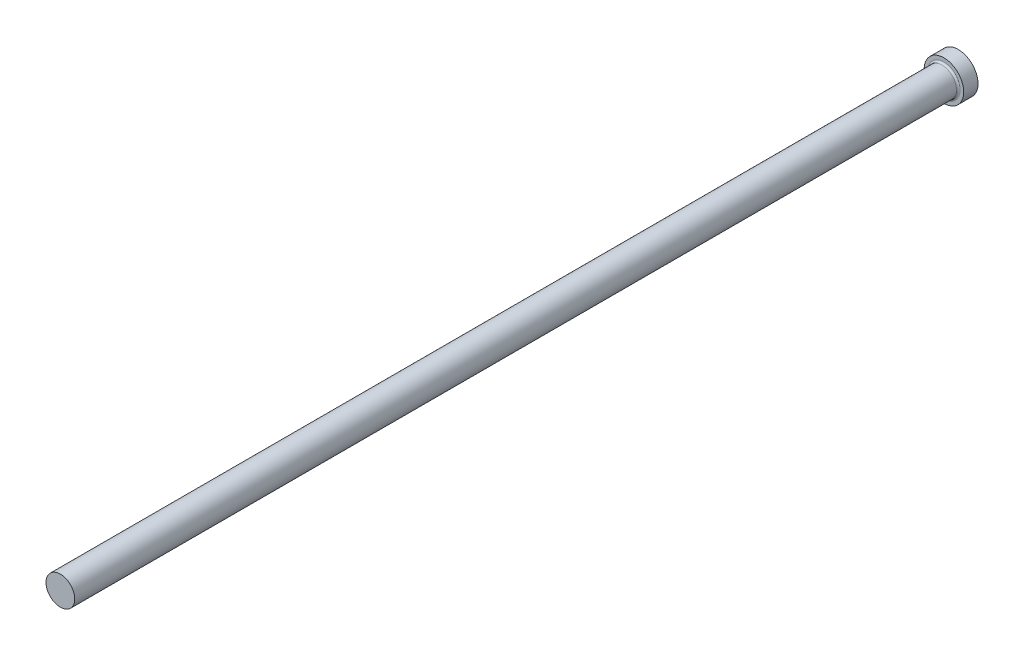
from build123d import *

# Parameters (mm, degrees)
FILLET1_R = 0.5


with BuildPart() as part:
    # FV → Revolve1 (revolve)
    with BuildSketch(Plane(origin=(0, 0, 0), x_dir=(1, 0, 0), z_dir=(0, 1, 0)), mode=Mode.PRIVATE) as revolve1_sk:
        Polygon((0, 0), (5.5, 0), (5.5, -4), (4, -4), (4, -250), (0, -250), align=None)
    revolve(revolve1_sk.sketch.rotate(Axis((0, 0, -9.033228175), (0, 0, 1)), 180), axis=Axis((0, 0, -9.033228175), (0, 0, 1)))

    # Fillet1
    fillet1_edges = [part.edges().sort_by_distance(p)[0] for p in [
        (4, 0, 4),
    ]]
    fillet(fillet1_edges, radius=FILLET1_R)


solid = part.part
